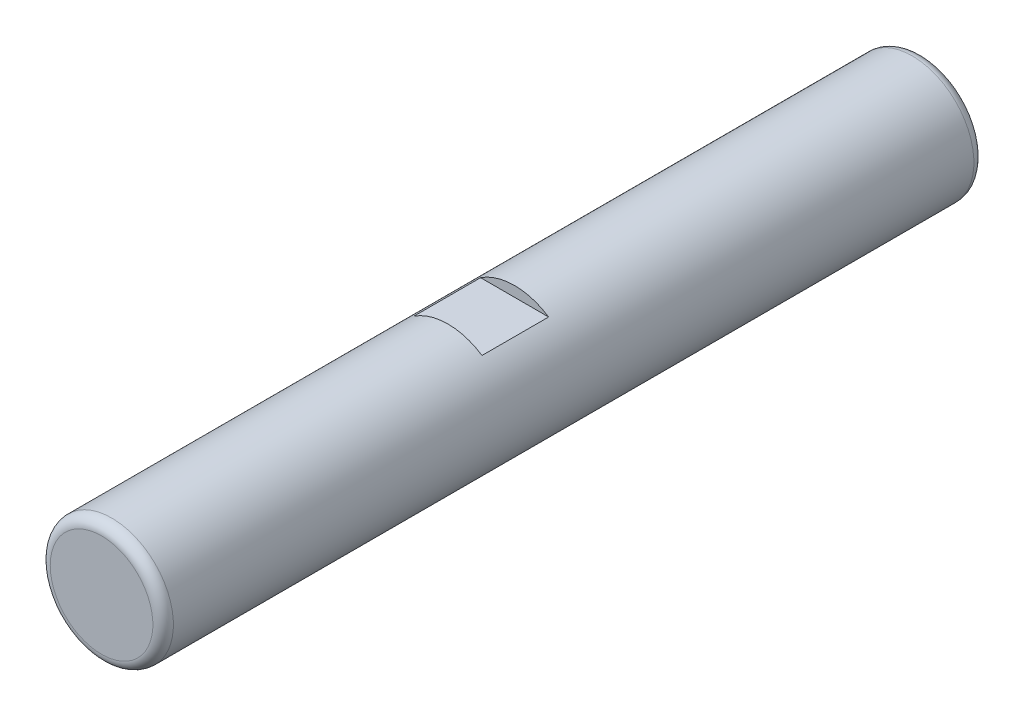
ISO-10303-21;
HEADER;
FILE_DESCRIPTION(('STEP AP214'),'2;1');
FILE_NAME('part.step','',(''),(''),'','','');
FILE_SCHEMA(('AUTOMOTIVE_DESIGN { 1 0 10303 214 1 1 1 1 }'));
ENDSEC;
DATA;
#1=APPLICATION_CONTEXT('core data for automotive mechanical design processes');
#2=APPLICATION_PROTOCOL_DEFINITION('international standard','automotive_design',2000,#1);
#3=PRODUCT_CONTEXT('',#1,'mechanical');
#4=PRODUCT('Part','Part','',(#3));
#5=PRODUCT_RELATED_PRODUCT_CATEGORY('part','',(#4));
#6=PRODUCT_DEFINITION_FORMATION('','',#4);
#7=PRODUCT_DEFINITION_CONTEXT('part definition',#1,'design');
#8=PRODUCT_DEFINITION('design','',#6,#7);
#9=PRODUCT_DEFINITION_SHAPE('','',#8);
#10=(LENGTH_UNIT() NAMED_UNIT(*) SI_UNIT(.MILLI.,.METRE.));
#11=(NAMED_UNIT(*) PLANE_ANGLE_UNIT() SI_UNIT($,.RADIAN.));
#12=(NAMED_UNIT(*) SI_UNIT($,.STERADIAN.) SOLID_ANGLE_UNIT());
#13=UNCERTAINTY_MEASURE_WITH_UNIT(LENGTH_MEASURE(1.E-05),#10,'distance_accuracy_value','');
#14=(GEOMETRIC_REPRESENTATION_CONTEXT(3) GLOBAL_UNCERTAINTY_ASSIGNED_CONTEXT((#13)) GLOBAL_UNIT_ASSIGNED_CONTEXT((#10,
#11,#12)) REPRESENTATION_CONTEXT('',''));
#15=CARTESIAN_POINT('',(0.,0.,0.));
#16=DIRECTION('',(0.,0.,1.));
#17=DIRECTION('',(1.,0.,0.));
#18=AXIS2_PLACEMENT_3D('',#15,#16,#17);
#19=CARTESIAN_POINT('',(0.,-1.66533453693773E-13,-41.5372037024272));
#20=DIRECTION('',(0.,0.,-1.));
#21=DIRECTION('',(-1.,0.,0.));
#22=AXIS2_PLACEMENT_3D('',#19,#20,#21);
#23=CYLINDRICAL_SURFACE('',#22,9.525);
#24=CARTESIAN_POINT('',(0.,-1.66533453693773E-13,-36.5125));
#25=DIRECTION('',(0.,0.,-1.));
#26=DIRECTION('',(-1.,0.,0.));
#27=AXIS2_PLACEMENT_3D('',#24,#25,#26);
#28=CIRCLE('',#27,9.52500000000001);
#29=CARTESIAN_POINT('',(-9.52500000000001,-1.66533453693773E-13,-36.5125));
#30=VERTEX_POINT('',#29);
#31=EDGE_CURVE('E122',#30,#30,#28,.T.);
#32=ORIENTED_EDGE('',*,*,#31,.F.);
#33=EDGE_LOOP('',(#32));
#34=FACE_BOUND('',#33,.T.);
#35=CARTESIAN_POINT('',(0.,-3.33066907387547E-13,87.3125));
#36=DIRECTION('',(0.,0.,-1.));
#37=DIRECTION('',(-1.,0.,0.));
#38=AXIS2_PLACEMENT_3D('',#35,#36,#37);
#39=CIRCLE('',#38,9.525);
#40=CARTESIAN_POINT('',(-9.525,-3.33066907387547E-13,87.3125));
#41=VERTEX_POINT('',#40);
#42=EDGE_CURVE('E118',#41,#41,#39,.T.);
#43=ORIENTED_EDGE('',*,*,#42,.T.);
#44=EDGE_LOOP('',(#43));
#45=FACE_BOUND('',#44,.T.);
#46=DIRECTION('',(0.,0.,-1.));
#47=VECTOR('',#46,1.);
#48=CARTESIAN_POINT('',(5.26514185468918,7.93749999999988,-41.5372037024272));
#49=LINE('',#48,#47);
#50=CARTESIAN_POINT('',(5.26514185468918,7.93749999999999,35.3187));
#51=VERTEX_POINT('',#50);
#52=CARTESIAN_POINT('',(5.26514185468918,7.93749999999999,25.0063));
#53=VERTEX_POINT('',#52);
#54=EDGE_CURVE('E13',#51,#53,#49,.T.);
#55=ORIENTED_EDGE('',*,*,#54,.F.);
#56=CARTESIAN_POINT('',(0.,0.,35.3187));
#57=DIRECTION('',(0.,0.,-1.));
#58=DIRECTION('',(-1.,0.,0.));
#59=AXIS2_PLACEMENT_3D('',#56,#57,#58);
#60=CIRCLE('',#59,9.525);
#61=CARTESIAN_POINT('',(-5.26514185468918,7.93749999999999,35.3187));
#62=VERTEX_POINT('',#61);
#63=EDGE_CURVE('E102',#62,#51,#60,.T.);
#64=ORIENTED_EDGE('',*,*,#63,.F.);
#65=DIRECTION('',(0.,0.,-1.));
#66=VECTOR('',#65,1.);
#67=CARTESIAN_POINT('',(-5.26514185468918,7.93749999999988,-41.5372037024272));
#68=LINE('',#67,#66);
#69=CARTESIAN_POINT('',(-5.26514185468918,7.93749999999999,25.0063));
#70=VERTEX_POINT('',#69);
#71=EDGE_CURVE('E96',#70,#62,#68,.F.);
#72=ORIENTED_EDGE('',*,*,#71,.F.);
#73=CARTESIAN_POINT('',(0.,0.,25.0063));
#74=DIRECTION('',(0.,0.,1.));
#75=DIRECTION('',(1.,0.,0.));
#76=AXIS2_PLACEMENT_3D('',#73,#74,#75);
#77=CIRCLE('',#76,9.525);
#78=EDGE_CURVE('E74',#53,#70,#77,.T.);
#79=ORIENTED_EDGE('',*,*,#78,.F.);
#80=EDGE_LOOP('',(#55,#64,#72,#79));
#81=FACE_BOUND('',#80,.T.);
#82=ADVANCED_FACE('F65',(#34,#45,#81),#23,.T.);
#83=CARTESIAN_POINT('',(0.,-1.66533453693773E-13,-38.1));
#84=DIRECTION('',(0.,0.,1.));
#85=DIRECTION('',(1.,0.,0.));
#86=AXIS2_PLACEMENT_3D('',#83,#84,#85);
#87=PLANE('',#86);
#88=CARTESIAN_POINT('',(0.,-1.66533453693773E-13,-38.1));
#89=DIRECTION('',(0.,0.,-1.));
#90=DIRECTION('',(-1.,0.,0.));
#91=AXIS2_PLACEMENT_3D('',#88,#89,#90);
#92=CIRCLE('',#91,7.9375);
#93=CARTESIAN_POINT('',(-7.9375,-1.66533453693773E-13,-38.1));
#94=VERTEX_POINT('',#93);
#95=EDGE_CURVE('E108',#94,#94,#92,.T.);
#96=ORIENTED_EDGE('',*,*,#95,.T.);
#97=EDGE_LOOP('',(#96));
#98=FACE_BOUND('',#97,.T.);
#99=ADVANCED_FACE('F67',(#98),#87,.F.);
#100=CARTESIAN_POINT('',(0.,-3.33066907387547E-13,88.9));
#101=DIRECTION('',(0.,0.,-1.));
#102=DIRECTION('',(-1.,0.,0.));
#103=AXIS2_PLACEMENT_3D('',#100,#101,#102);
#104=PLANE('',#103);
#105=CARTESIAN_POINT('',(0.,-3.33066907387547E-13,88.9));
#106=DIRECTION('',(0.,0.,-1.));
#107=DIRECTION('',(-1.,0.,0.));
#108=AXIS2_PLACEMENT_3D('',#105,#106,#107);
#109=CIRCLE('',#108,7.93749999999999);
#110=CARTESIAN_POINT('',(-7.93749999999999,-3.33066907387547E-13,88.9));
#111=VERTEX_POINT('',#110);
#112=EDGE_CURVE('E103',#111,#111,#109,.T.);
#113=ORIENTED_EDGE('',*,*,#112,.F.);
#114=EDGE_LOOP('',(#113));
#115=FACE_BOUND('',#114,.T.);
#116=ADVANCED_FACE('F167',(#115),#104,.F.);
#117=CARTESIAN_POINT('',(0.,-3.33066907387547E-13,87.3125));
#118=DIRECTION('',(0.,0.,-1.));
#119=DIRECTION('',(-1.,0.,0.));
#120=AXIS2_PLACEMENT_3D('',#117,#118,#119);
#121=TOROIDAL_SURFACE('',#120,7.9375,1.5875);
#122=ORIENTED_EDGE('',*,*,#42,.F.);
#123=EDGE_LOOP('',(#122));
#124=FACE_BOUND('',#123,.T.);
#125=ORIENTED_EDGE('',*,*,#112,.T.);
#126=EDGE_LOOP('',(#125));
#127=FACE_BOUND('',#126,.T.);
#128=ADVANCED_FACE('F156',(#124,#127),#121,.T.);
#129=CARTESIAN_POINT('',(0.,-1.66533453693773E-13,-36.5125));
#130=DIRECTION('',(0.,0.,-1.));
#131=DIRECTION('',(-1.,0.,0.));
#132=AXIS2_PLACEMENT_3D('',#129,#130,#131);
#133=TOROIDAL_SURFACE('',#132,7.93750000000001,1.5875);
#134=ORIENTED_EDGE('',*,*,#95,.F.);
#135=EDGE_LOOP('',(#134));
#136=FACE_BOUND('',#135,.T.);
#137=ORIENTED_EDGE('',*,*,#31,.T.);
#138=EDGE_LOOP('',(#137));
#139=FACE_BOUND('',#138,.T.);
#140=ADVANCED_FACE('F152',(#136,#139),#133,.T.);
#141=CARTESIAN_POINT('',(15.8749999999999,9.52500000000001,25.0063));
#142=DIRECTION('',(0.,0.,1.));
#143=DIRECTION('',(1.,0.,0.));
#144=AXIS2_PLACEMENT_3D('',#141,#142,#143);
#145=PLANE('',#144);
#146=DIRECTION('',(-1.,0.,0.));
#147=VECTOR('',#146,1.);
#148=CARTESIAN_POINT('',(15.8749999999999,7.93749999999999,25.0063));
#149=LINE('',#148,#147);
#150=EDGE_CURVE('E83',#53,#70,#149,.T.);
#151=ORIENTED_EDGE('',*,*,#150,.F.);
#152=ORIENTED_EDGE('',*,*,#78,.T.);
#153=EDGE_LOOP('',(#151,#152));
#154=FACE_BOUND('',#153,.T.);
#155=ADVANCED_FACE('F155',(#154),#145,.T.);
#156=CARTESIAN_POINT('',(15.8749999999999,9.52500000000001,35.3187));
#157=DIRECTION('',(0.,0.,-1.));
#158=DIRECTION('',(-1.,0.,0.));
#159=AXIS2_PLACEMENT_3D('',#156,#157,#158);
#160=PLANE('',#159);
#161=ORIENTED_EDGE('',*,*,#63,.T.);
#162=DIRECTION('',(1.,0.,0.));
#163=VECTOR('',#162,1.);
#164=CARTESIAN_POINT('',(15.8749999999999,7.93749999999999,35.3187));
#165=LINE('',#164,#163);
#166=EDGE_CURVE('E99',#62,#51,#165,.T.);
#167=ORIENTED_EDGE('',*,*,#166,.F.);
#168=EDGE_LOOP('',(#161,#167));
#169=FACE_BOUND('',#168,.T.);
#170=ADVANCED_FACE('F106',(#169),#160,.T.);
#171=CARTESIAN_POINT('',(0.,7.93750000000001,0.));
#172=DIRECTION('',(0.,1.,0.));
#173=DIRECTION('',(0.,0.,1.));
#174=AXIS2_PLACEMENT_3D('',#171,#172,#173);
#175=PLANE('',#174);
#176=ORIENTED_EDGE('',*,*,#54,.T.);
#177=ORIENTED_EDGE('',*,*,#150,.T.);
#178=ORIENTED_EDGE('',*,*,#71,.T.);
#179=ORIENTED_EDGE('',*,*,#166,.T.);
#180=EDGE_LOOP('',(#176,#177,#178,#179));
#181=FACE_BOUND('',#180,.T.);
#182=ADVANCED_FACE('F98',(#181),#175,.T.);
#183=CLOSED_SHELL('',(#82,#99,#116,#128,#140,#155,#170,#182));
#184=MANIFOLD_SOLID_BREP('B2',#183);
#185=ADVANCED_BREP_SHAPE_REPRESENTATION('',(#18,#184),#14);
#186=SHAPE_DEFINITION_REPRESENTATION(#9,#185);
ENDSEC;
END-ISO-10303-21;
